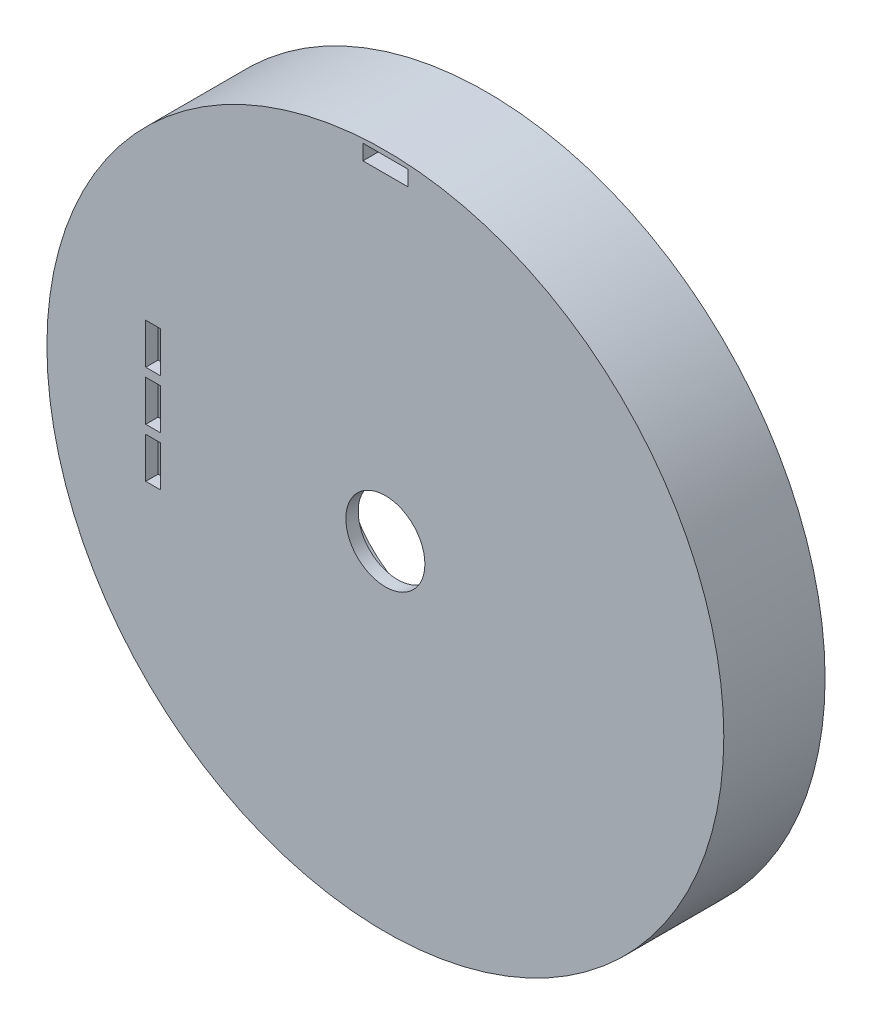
ISO-10303-21;
HEADER;
FILE_DESCRIPTION(('STEP AP214'),'2;1');
FILE_NAME('part.step','',(''),(''),'','','');
FILE_SCHEMA(('AUTOMOTIVE_DESIGN { 1 0 10303 214 1 1 1 1 }'));
ENDSEC;
DATA;
#1=APPLICATION_CONTEXT('core data for automotive mechanical design processes');
#2=APPLICATION_PROTOCOL_DEFINITION('international standard','automotive_design',2000,#1);
#3=PRODUCT_CONTEXT('',#1,'mechanical');
#4=PRODUCT('Part','Part','',(#3));
#5=PRODUCT_RELATED_PRODUCT_CATEGORY('part','',(#4));
#6=PRODUCT_DEFINITION_FORMATION('','',#4);
#7=PRODUCT_DEFINITION_CONTEXT('part definition',#1,'design');
#8=PRODUCT_DEFINITION('design','',#6,#7);
#9=PRODUCT_DEFINITION_SHAPE('','',#8);
#10=(LENGTH_UNIT() NAMED_UNIT(*) SI_UNIT(.MILLI.,.METRE.));
#11=(NAMED_UNIT(*) PLANE_ANGLE_UNIT() SI_UNIT($,.RADIAN.));
#12=(NAMED_UNIT(*) SI_UNIT($,.STERADIAN.) SOLID_ANGLE_UNIT());
#13=UNCERTAINTY_MEASURE_WITH_UNIT(LENGTH_MEASURE(1.E-05),#10,'distance_accuracy_value','');
#14=(GEOMETRIC_REPRESENTATION_CONTEXT(3) GLOBAL_UNCERTAINTY_ASSIGNED_CONTEXT((#13)) GLOBAL_UNIT_ASSIGNED_CONTEXT((#10,
#11,#12)) REPRESENTATION_CONTEXT('',''));
#15=CARTESIAN_POINT('',(0.,0.,0.));
#16=DIRECTION('',(0.,0.,1.));
#17=DIRECTION('',(1.,0.,0.));
#18=AXIS2_PLACEMENT_3D('',#15,#16,#17);
#19=CARTESIAN_POINT('',(0.,0.,0.));
#20=DIRECTION('',(0.,0.,1.));
#21=DIRECTION('',(1.,0.,0.));
#22=AXIS2_PLACEMENT_3D('',#19,#20,#21);
#23=PLANE('',#22);
#24=CARTESIAN_POINT('',(0.,0.,0.));
#25=DIRECTION('',(0.,0.,1.));
#26=DIRECTION('',(1.,0.,0.));
#27=AXIS2_PLACEMENT_3D('',#24,#25,#26);
#28=CIRCLE('',#27,10.48);
#29=CARTESIAN_POINT('',(10.48,0.,0.));
#30=VERTEX_POINT('',#29);
#31=EDGE_CURVE('E246',#30,#30,#28,.T.);
#32=ORIENTED_EDGE('',*,*,#31,.T.);
#33=EDGE_LOOP('',(#32));
#34=FACE_BOUND('',#33,.T.);
#35=CARTESIAN_POINT('',(0.,0.,0.));
#36=DIRECTION('',(0.,0.,-1.));
#37=DIRECTION('',(-1.,0.,0.));
#38=AXIS2_PLACEMENT_3D('',#35,#36,#37);
#39=CIRCLE('',#38,26.2);
#40=CARTESIAN_POINT('',(-26.2,0.,0.));
#41=VERTEX_POINT('',#40);
#42=EDGE_CURVE('E317',#41,#41,#39,.T.);
#43=ORIENTED_EDGE('',*,*,#42,.T.);
#44=EDGE_LOOP('',(#43));
#45=FACE_BOUND('',#44,.T.);
#46=ADVANCED_FACE('F32',(#34,#45),#23,.F.);
#47=CARTESIAN_POINT('',(0.,0.,-23.58));
#48=DIRECTION('',(0.,0.,-1.));
#49=DIRECTION('',(-1.,0.,0.));
#50=AXIS2_PLACEMENT_3D('',#47,#48,#49);
#51=PLANE('',#50);
#52=DIRECTION('',(0.,-1.,0.));
#53=VECTOR('',#52,1.);
#54=CARTESIAN_POINT('',(-5.94085,0.,-23.58));
#55=LINE('',#54,#53);
#56=CARTESIAN_POINT('',(-5.94085,88.425,-23.58));
#57=VERTEX_POINT('',#56);
#58=CARTESIAN_POINT('',(-5.94085,84.37055,-23.58));
#59=VERTEX_POINT('',#58);
#60=EDGE_CURVE('E255',#57,#59,#55,.T.);
#61=ORIENTED_EDGE('',*,*,#60,.T.);
#62=DIRECTION('',(1.,0.,0.));
#63=VECTOR('',#62,1.);
#64=CARTESIAN_POINT('',(0.,84.37055,-23.58));
#65=LINE('',#64,#63);
#66=CARTESIAN_POINT('',(5.94085,84.37055,-23.58));
#67=VERTEX_POINT('',#66);
#68=EDGE_CURVE('E264',#59,#67,#65,.T.);
#69=ORIENTED_EDGE('',*,*,#68,.T.);
#70=DIRECTION('',(0.,1.,0.));
#71=VECTOR('',#70,1.);
#72=CARTESIAN_POINT('',(5.94085,0.,-23.58));
#73=LINE('',#72,#71);
#74=CARTESIAN_POINT('',(5.94085,88.425,-23.58));
#75=VERTEX_POINT('',#74);
#76=EDGE_CURVE('E261',#67,#75,#73,.T.);
#77=ORIENTED_EDGE('',*,*,#76,.T.);
#78=DIRECTION('',(-1.,0.,0.));
#79=VECTOR('',#78,1.);
#80=CARTESIAN_POINT('',(0.,88.425,-23.58));
#81=LINE('',#80,#79);
#82=EDGE_CURVE('E258',#75,#57,#81,.T.);
#83=ORIENTED_EDGE('',*,*,#82,.T.);
#84=EDGE_LOOP('',(#61,#69,#77,#83));
#85=FACE_BOUND('',#84,.T.);
#86=CARTESIAN_POINT('',(0.,0.,-23.58));
#87=DIRECTION('',(0.,0.,-1.));
#88=DIRECTION('',(-1.,0.,0.));
#89=AXIS2_PLACEMENT_3D('',#86,#87,#88);
#90=CIRCLE('',#89,89.735);
#91=CARTESIAN_POINT('',(-89.735,0.,-23.58));
#92=VERTEX_POINT('',#91);
#93=EDGE_CURVE('E243',#92,#92,#90,.T.);
#94=ORIENTED_EDGE('',*,*,#93,.T.);
#95=EDGE_LOOP('',(#94));
#96=FACE_BOUND('',#95,.T.);
#97=CARTESIAN_POINT('',(0.,0.,-23.58));
#98=DIRECTION('',(0.,0.,-1.));
#99=DIRECTION('',(-1.,0.,0.));
#100=AXIS2_PLACEMENT_3D('',#97,#98,#99);
#101=CIRCLE('',#100,82.8575);
#102=CARTESIAN_POINT('',(82.8575,0.,-23.58));
#103=VERTEX_POINT('',#102);
#104=EDGE_CURVE('E305',#103,#103,#101,.T.);
#105=ORIENTED_EDGE('',*,*,#104,.F.);
#106=EDGE_LOOP('',(#105));
#107=FACE_BOUND('',#106,.T.);
#108=ADVANCED_FACE('F343',(#85,#96,#107),#51,.T.);
#109=CARTESIAN_POINT('',(0.,0.,3.275));
#110=DIRECTION('',(0.,0.,1.));
#111=DIRECTION('',(1.,0.,0.));
#112=AXIS2_PLACEMENT_3D('',#109,#110,#111);
#113=PLANE('',#112);
#114=DIRECTION('',(1.,0.,0.));
#115=VECTOR('',#114,1.);
#116=CARTESIAN_POINT('',(0.,-4.91250000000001,3.275));
#117=LINE('',#116,#115);
#118=CARTESIAN_POINT('',(-63.535,-4.91250000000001,3.275));
#119=VERTEX_POINT('',#118);
#120=CARTESIAN_POINT('',(-59.605,-4.91250000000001,3.275));
#121=VERTEX_POINT('',#120);
#122=EDGE_CURVE('E47',#119,#121,#117,.T.);
#123=ORIENTED_EDGE('',*,*,#122,.F.);
#124=DIRECTION('',(0.,-1.,0.));
#125=VECTOR('',#124,1.);
#126=CARTESIAN_POINT('',(-63.535,0.,3.275));
#127=LINE('',#126,#125);
#128=CARTESIAN_POINT('',(-63.535,5.89499999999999,3.275));
#129=VERTEX_POINT('',#128);
#130=EDGE_CURVE('E169',#129,#119,#127,.T.);
#131=ORIENTED_EDGE('',*,*,#130,.F.);
#132=DIRECTION('',(1.,0.,0.));
#133=VECTOR('',#132,1.);
#134=CARTESIAN_POINT('',(0.,5.89499999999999,3.275));
#135=LINE('',#134,#133);
#136=CARTESIAN_POINT('',(-59.605,5.89499999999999,3.275));
#137=VERTEX_POINT('',#136);
#138=EDGE_CURVE('E152',#129,#137,#135,.T.);
#139=ORIENTED_EDGE('',*,*,#138,.T.);
#140=DIRECTION('',(0.,1.,0.));
#141=VECTOR('',#140,1.);
#142=CARTESIAN_POINT('',(-59.605,0.,3.275));
#143=LINE('',#142,#141);
#144=EDGE_CURVE('E162',#121,#137,#143,.T.);
#145=ORIENTED_EDGE('',*,*,#144,.F.);
#146=EDGE_LOOP('',(#123,#131,#139,#145));
#147=FACE_BOUND('',#146,.T.);
#148=DIRECTION('',(0.,-1.,0.));
#149=VECTOR('',#148,1.);
#150=CARTESIAN_POINT('',(-63.535,0.,3.275));
#151=LINE('',#150,#149);
#152=CARTESIAN_POINT('',(-63.535,18.995,3.275));
#153=VERTEX_POINT('',#152);
#154=CARTESIAN_POINT('',(-63.535,8.18749999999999,3.275));
#155=VERTEX_POINT('',#154);
#156=EDGE_CURVE('E55',#153,#155,#151,.T.);
#157=ORIENTED_EDGE('',*,*,#156,.F.);
#158=DIRECTION('',(-1.,0.,0.));
#159=VECTOR('',#158,1.);
#160=CARTESIAN_POINT('',(0.,18.995,3.275));
#161=LINE('',#160,#159);
#162=CARTESIAN_POINT('',(-59.605,18.995,3.275));
#163=VERTEX_POINT('',#162);
#164=EDGE_CURVE('E187',#163,#153,#161,.T.);
#165=ORIENTED_EDGE('',*,*,#164,.F.);
#166=DIRECTION('',(0.,-1.,0.));
#167=VECTOR('',#166,1.);
#168=CARTESIAN_POINT('',(-59.605,0.,3.275));
#169=LINE('',#168,#167);
#170=CARTESIAN_POINT('',(-59.605,8.18749999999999,3.275));
#171=VERTEX_POINT('',#170);
#172=EDGE_CURVE('E184',#163,#171,#169,.T.);
#173=ORIENTED_EDGE('',*,*,#172,.T.);
#174=DIRECTION('',(1.,0.,0.));
#175=VECTOR('',#174,1.);
#176=CARTESIAN_POINT('',(0.,8.18749999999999,3.275));
#177=LINE('',#176,#175);
#178=EDGE_CURVE('E180',#155,#171,#177,.T.);
#179=ORIENTED_EDGE('',*,*,#178,.F.);
#180=EDGE_LOOP('',(#157,#165,#173,#179));
#181=FACE_BOUND('',#180,.T.);
#182=DIRECTION('',(0.,1.,0.));
#183=VECTOR('',#182,1.);
#184=CARTESIAN_POINT('',(-59.605,0.,3.275));
#185=LINE('',#184,#183);
#186=CARTESIAN_POINT('',(-59.605,-18.0125,3.275));
#187=VERTEX_POINT('',#186);
#188=CARTESIAN_POINT('',(-59.605,-7.20500000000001,3.275));
#189=VERTEX_POINT('',#188);
#190=EDGE_CURVE('E176',#187,#189,#185,.T.);
#191=ORIENTED_EDGE('',*,*,#190,.F.);
#192=DIRECTION('',(1.,0.,0.));
#193=VECTOR('',#192,1.);
#194=CARTESIAN_POINT('',(0.,-18.0125,3.275));
#195=LINE('',#194,#193);
#196=CARTESIAN_POINT('',(-63.535,-18.0125,3.275));
#197=VERTEX_POINT('',#196);
#198=EDGE_CURVE('E205',#197,#187,#195,.T.);
#199=ORIENTED_EDGE('',*,*,#198,.F.);
#200=DIRECTION('',(0.,-1.,0.));
#201=VECTOR('',#200,1.);
#202=CARTESIAN_POINT('',(-63.535,0.,3.275));
#203=LINE('',#202,#201);
#204=CARTESIAN_POINT('',(-63.535,-7.20500000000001,3.275));
#205=VERTEX_POINT('',#204);
#206=EDGE_CURVE('E202',#205,#197,#203,.T.);
#207=ORIENTED_EDGE('',*,*,#206,.F.);
#208=DIRECTION('',(-1.,0.,0.));
#209=VECTOR('',#208,1.);
#210=CARTESIAN_POINT('',(0.,-7.20500000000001,3.275));
#211=LINE('',#210,#209);
#212=EDGE_CURVE('E199',#189,#205,#211,.T.);
#213=ORIENTED_EDGE('',*,*,#212,.F.);
#214=EDGE_LOOP('',(#191,#199,#207,#213));
#215=FACE_BOUND('',#214,.T.);
#216=CARTESIAN_POINT('',(0.,0.,3.275));
#217=DIRECTION('',(0.,0.,1.));
#218=DIRECTION('',(1.,0.,0.));
#219=AXIS2_PLACEMENT_3D('',#216,#217,#218);
#220=CIRCLE('',#219,89.735);
#221=CARTESIAN_POINT('',(89.735,0.,3.275));
#222=VERTEX_POINT('',#221);
#223=EDGE_CURVE('E250',#222,#222,#220,.T.);
#224=ORIENTED_EDGE('',*,*,#223,.T.);
#225=EDGE_LOOP('',(#224));
#226=FACE_BOUND('',#225,.T.);
#227=CARTESIAN_POINT('',(0.,0.,3.275));
#228=DIRECTION('',(0.,0.,1.));
#229=DIRECTION('',(1.,0.,0.));
#230=AXIS2_PLACEMENT_3D('',#227,#228,#229);
#231=CIRCLE('',#230,10.48);
#232=CARTESIAN_POINT('',(10.48,0.,3.275));
#233=VERTEX_POINT('',#232);
#234=EDGE_CURVE('E247',#233,#233,#231,.T.);
#235=ORIENTED_EDGE('',*,*,#234,.F.);
#236=EDGE_LOOP('',(#235));
#237=FACE_BOUND('',#236,.T.);
#238=DIRECTION('',(0.,-1.,0.));
#239=VECTOR('',#238,1.);
#240=CARTESIAN_POINT('',(5.94085,0.,3.275));
#241=LINE('',#240,#239);
#242=CARTESIAN_POINT('',(5.94085,88.425,3.275));
#243=VERTEX_POINT('',#242);
#244=CARTESIAN_POINT('',(5.94085,84.37055,3.275));
#245=VERTEX_POINT('',#244);
#246=EDGE_CURVE('E234',#243,#245,#241,.T.);
#247=ORIENTED_EDGE('',*,*,#246,.T.);
#248=DIRECTION('',(-1.,0.,0.));
#249=VECTOR('',#248,1.);
#250=CARTESIAN_POINT('',(0.,84.37055,3.275));
#251=LINE('',#250,#249);
#252=CARTESIAN_POINT('',(-5.94085,84.37055,3.275));
#253=VERTEX_POINT('',#252);
#254=EDGE_CURVE('E237',#245,#253,#251,.T.);
#255=ORIENTED_EDGE('',*,*,#254,.T.);
#256=DIRECTION('',(0.,1.,0.));
#257=VECTOR('',#256,1.);
#258=CARTESIAN_POINT('',(-5.94085,0.,3.275));
#259=LINE('',#258,#257);
#260=CARTESIAN_POINT('',(-5.94085,88.425,3.275));
#261=VERTEX_POINT('',#260);
#262=EDGE_CURVE('E228',#253,#261,#259,.T.);
#263=ORIENTED_EDGE('',*,*,#262,.T.);
#264=DIRECTION('',(1.,0.,0.));
#265=VECTOR('',#264,1.);
#266=CARTESIAN_POINT('',(0.,88.425,3.275));
#267=LINE('',#266,#265);
#268=EDGE_CURVE('E231',#261,#243,#267,.T.);
#269=ORIENTED_EDGE('',*,*,#268,.T.);
#270=EDGE_LOOP('',(#247,#255,#263,#269));
#271=FACE_BOUND('',#270,.T.);
#272=ADVANCED_FACE('F166',(#147,#181,#215,#226,#237,#271),#113,.T.);
#273=CARTESIAN_POINT('',(0.,0.,0.));
#274=DIRECTION('',(0.,0.,1.));
#275=DIRECTION('',(1.,0.,0.));
#276=AXIS2_PLACEMENT_3D('',#273,#274,#275);
#277=CIRCLE('',#276,29.475);
#278=CARTESIAN_POINT('',(29.475,0.,0.));
#279=VERTEX_POINT('',#278);
#280=EDGE_CURVE('E11',#279,#279,#277,.F.);
#281=ORIENTED_EDGE('',*,*,#280,.F.);
#282=EDGE_LOOP('',(#281));
#283=FACE_BOUND('',#282,.T.);
#284=DIRECTION('',(0.,-1.,0.));
#285=VECTOR('',#284,1.);
#286=CARTESIAN_POINT('',(-63.535,0.,0.));
#287=LINE('',#286,#285);
#288=CARTESIAN_POINT('',(-63.535,5.89499999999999,0.));
#289=VERTEX_POINT('',#288);
#290=CARTESIAN_POINT('',(-63.535,-4.91250000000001,0.));
#291=VERTEX_POINT('',#290);
#292=EDGE_CURVE('E294',#289,#291,#287,.T.);
#293=ORIENTED_EDGE('',*,*,#292,.T.);
#294=DIRECTION('',(1.,0.,0.));
#295=VECTOR('',#294,1.);
#296=CARTESIAN_POINT('',(0.,-4.91250000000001,0.));
#297=LINE('',#296,#295);
#298=CARTESIAN_POINT('',(-59.605,-4.91250000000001,0.));
#299=VERTEX_POINT('',#298);
#300=EDGE_CURVE('E40',#291,#299,#297,.T.);
#301=ORIENTED_EDGE('',*,*,#300,.T.);
#302=DIRECTION('',(0.,1.,0.));
#303=VECTOR('',#302,1.);
#304=CARTESIAN_POINT('',(-59.605,0.,0.));
#305=LINE('',#304,#303);
#306=CARTESIAN_POINT('',(-59.605,5.89499999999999,0.));
#307=VERTEX_POINT('',#306);
#308=EDGE_CURVE('E291',#299,#307,#305,.T.);
#309=ORIENTED_EDGE('',*,*,#308,.T.);
#310=DIRECTION('',(1.,0.,0.));
#311=VECTOR('',#310,1.);
#312=CARTESIAN_POINT('',(0.,5.89499999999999,0.));
#313=LINE('',#312,#311);
#314=EDGE_CURVE('E155',#289,#307,#313,.T.);
#315=ORIENTED_EDGE('',*,*,#314,.F.);
#316=EDGE_LOOP('',(#293,#301,#309,#315));
#317=FACE_BOUND('',#316,.T.);
#318=DIRECTION('',(-1.,0.,0.));
#319=VECTOR('',#318,1.);
#320=CARTESIAN_POINT('',(0.,18.995,0.));
#321=LINE('',#320,#319);
#322=CARTESIAN_POINT('',(-59.605,18.995,0.));
#323=VERTEX_POINT('',#322);
#324=CARTESIAN_POINT('',(-63.535,18.995,0.));
#325=VERTEX_POINT('',#324);
#326=EDGE_CURVE('E285',#323,#325,#321,.T.);
#327=ORIENTED_EDGE('',*,*,#326,.T.);
#328=DIRECTION('',(0.,-1.,0.));
#329=VECTOR('',#328,1.);
#330=CARTESIAN_POINT('',(-63.535,0.,0.));
#331=LINE('',#330,#329);
#332=CARTESIAN_POINT('',(-63.535,8.18749999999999,0.));
#333=VERTEX_POINT('',#332);
#334=EDGE_CURVE('E288',#325,#333,#331,.T.);
#335=ORIENTED_EDGE('',*,*,#334,.T.);
#336=DIRECTION('',(1.,0.,0.));
#337=VECTOR('',#336,1.);
#338=CARTESIAN_POINT('',(0.,8.18749999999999,0.));
#339=LINE('',#338,#337);
#340=CARTESIAN_POINT('',(-59.605,8.18749999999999,0.));
#341=VERTEX_POINT('',#340);
#342=EDGE_CURVE('E279',#333,#341,#339,.T.);
#343=ORIENTED_EDGE('',*,*,#342,.T.);
#344=DIRECTION('',(0.,-1.,0.));
#345=VECTOR('',#344,1.);
#346=CARTESIAN_POINT('',(-59.605,0.,0.));
#347=LINE('',#346,#345);
#348=EDGE_CURVE('E282',#323,#341,#347,.T.);
#349=ORIENTED_EDGE('',*,*,#348,.F.);
#350=EDGE_LOOP('',(#327,#335,#343,#349));
#351=FACE_BOUND('',#350,.T.);
#352=DIRECTION('',(1.,0.,0.));
#353=VECTOR('',#352,1.);
#354=CARTESIAN_POINT('',(0.,-18.0125,0.));
#355=LINE('',#354,#353);
#356=CARTESIAN_POINT('',(-63.535,-18.0125,0.));
#357=VERTEX_POINT('',#356);
#358=CARTESIAN_POINT('',(-59.605,-18.0125,0.));
#359=VERTEX_POINT('',#358);
#360=EDGE_CURVE('E273',#357,#359,#355,.T.);
#361=ORIENTED_EDGE('',*,*,#360,.T.);
#362=DIRECTION('',(0.,1.,0.));
#363=VECTOR('',#362,1.);
#364=CARTESIAN_POINT('',(-59.605,0.,0.));
#365=LINE('',#364,#363);
#366=CARTESIAN_POINT('',(-59.605,-7.20500000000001,0.));
#367=VERTEX_POINT('',#366);
#368=EDGE_CURVE('E276',#359,#367,#365,.T.);
#369=ORIENTED_EDGE('',*,*,#368,.T.);
#370=DIRECTION('',(-1.,0.,0.));
#371=VECTOR('',#370,1.);
#372=CARTESIAN_POINT('',(0.,-7.20500000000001,0.));
#373=LINE('',#372,#371);
#374=CARTESIAN_POINT('',(-63.535,-7.20500000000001,0.));
#375=VERTEX_POINT('',#374);
#376=EDGE_CURVE('E267',#367,#375,#373,.T.);
#377=ORIENTED_EDGE('',*,*,#376,.T.);
#378=DIRECTION('',(0.,-1.,0.));
#379=VECTOR('',#378,1.);
#380=CARTESIAN_POINT('',(-63.535,0.,0.));
#381=LINE('',#380,#379);
#382=EDGE_CURVE('E270',#375,#357,#381,.T.);
#383=ORIENTED_EDGE('',*,*,#382,.T.);
#384=EDGE_LOOP('',(#361,#369,#377,#383));
#385=FACE_BOUND('',#384,.T.);
#386=CARTESIAN_POINT('',(0.,0.,0.));
#387=DIRECTION('',(0.,0.,-1.));
#388=DIRECTION('',(-1.,0.,0.));
#389=AXIS2_PLACEMENT_3D('',#386,#387,#388);
#390=CIRCLE('',#389,80.2375);
#391=CARTESIAN_POINT('',(-80.2375,0.,0.));
#392=VERTEX_POINT('',#391);
#393=EDGE_CURVE('E240',#392,#392,#390,.T.);
#394=ORIENTED_EDGE('',*,*,#393,.T.);
#395=EDGE_LOOP('',(#394));
#396=FACE_BOUND('',#395,.T.);
#397=ADVANCED_FACE('F298',(#283,#317,#351,#385,#396),#23,.F.);
#398=CARTESIAN_POINT('',(0.,0.,3.275));
#399=DIRECTION('',(0.,0.,-1.));
#400=DIRECTION('',(-1.,0.,0.));
#401=AXIS2_PLACEMENT_3D('',#398,#399,#400);
#402=CYLINDRICAL_SURFACE('',#401,89.735);
#403=ORIENTED_EDGE('',*,*,#223,.F.);
#404=EDGE_LOOP('',(#403));
#405=FACE_BOUND('',#404,.T.);
#406=ORIENTED_EDGE('',*,*,#93,.F.);
#407=EDGE_LOOP('',(#406));
#408=FACE_BOUND('',#407,.T.);
#409=ADVANCED_FACE('F34',(#405,#408),#402,.T.);
#410=CARTESIAN_POINT('',(0.,0.,3.275));
#411=DIRECTION('',(0.,0.,-1.));
#412=DIRECTION('',(-1.,0.,0.));
#413=AXIS2_PLACEMENT_3D('',#410,#411,#412);
#414=CYLINDRICAL_SURFACE('',#413,10.48);
#415=ORIENTED_EDGE('',*,*,#234,.T.);
#416=EDGE_LOOP('',(#415));
#417=FACE_BOUND('',#416,.T.);
#418=ORIENTED_EDGE('',*,*,#31,.F.);
#419=EDGE_LOOP('',(#418));
#420=FACE_BOUND('',#419,.T.);
#421=ADVANCED_FACE('F358',(#417,#420),#414,.F.);
#422=CARTESIAN_POINT('',(0.,0.,-23.58));
#423=DIRECTION('',(0.,0.,1.));
#424=DIRECTION('',(1.,0.,0.));
#425=AXIS2_PLACEMENT_3D('',#422,#423,#424);
#426=CYLINDRICAL_SURFACE('',#425,80.2375);
#427=ORIENTED_EDGE('',*,*,#393,.F.);
#428=EDGE_LOOP('',(#427));
#429=FACE_BOUND('',#428,.T.);
#430=CARTESIAN_POINT('',(0.,0.,-26.65999995));
#431=DIRECTION('',(0.,0.,-1.));
#432=DIRECTION('',(-1.,0.,0.));
#433=AXIS2_PLACEMENT_3D('',#430,#431,#432);
#434=CIRCLE('',#433,80.2375);
#435=CARTESIAN_POINT('',(-80.2375,0.,-26.65999995));
#436=VERTEX_POINT('',#435);
#437=EDGE_CURVE('E308',#436,#436,#434,.T.);
#438=ORIENTED_EDGE('',*,*,#437,.T.);
#439=EDGE_LOOP('',(#438));
#440=FACE_BOUND('',#439,.T.);
#441=ADVANCED_FACE('F366',(#429,#440),#426,.F.);
#442=CARTESIAN_POINT('',(-5.94085,84.37055,22.0735));
#443=DIRECTION('',(0.,1.,0.));
#444=DIRECTION('',(0.,0.,1.));
#445=AXIS2_PLACEMENT_3D('',#442,#443,#444);
#446=PLANE('',#445);
#447=DIRECTION('',(0.,0.,-1.));
#448=VECTOR('',#447,1.);
#449=CARTESIAN_POINT('',(5.94085,84.37055,22.0735));
#450=LINE('',#449,#448);
#451=EDGE_CURVE('E225',#245,#67,#450,.T.);
#452=ORIENTED_EDGE('',*,*,#451,.T.);
#453=ORIENTED_EDGE('',*,*,#68,.F.);
#454=DIRECTION('',(0.,0.,-1.));
#455=VECTOR('',#454,1.);
#456=CARTESIAN_POINT('',(-5.94085,84.37055,22.0735));
#457=LINE('',#456,#455);
#458=EDGE_CURVE('E211',#253,#59,#457,.T.);
#459=ORIENTED_EDGE('',*,*,#458,.F.);
#460=ORIENTED_EDGE('',*,*,#254,.F.);
#461=EDGE_LOOP('',(#452,#453,#459,#460));
#462=FACE_BOUND('',#461,.T.);
#463=ADVANCED_FACE('F371',(#462),#446,.T.);
#464=CARTESIAN_POINT('',(5.94085,88.425,22.0735));
#465=DIRECTION('',(-1.,0.,0.));
#466=DIRECTION('',(0.,0.,1.));
#467=AXIS2_PLACEMENT_3D('',#464,#465,#466);
#468=PLANE('',#467);
#469=DIRECTION('',(0.,0.,-1.));
#470=VECTOR('',#469,1.);
#471=CARTESIAN_POINT('',(5.94085,88.425,22.0735));
#472=LINE('',#471,#470);
#473=EDGE_CURVE('E222',#243,#75,#472,.T.);
#474=ORIENTED_EDGE('',*,*,#473,.T.);
#475=ORIENTED_EDGE('',*,*,#76,.F.);
#476=ORIENTED_EDGE('',*,*,#451,.F.);
#477=ORIENTED_EDGE('',*,*,#246,.F.);
#478=EDGE_LOOP('',(#474,#475,#476,#477));
#479=FACE_BOUND('',#478,.T.);
#480=ADVANCED_FACE('F375',(#479),#468,.T.);
#481=CARTESIAN_POINT('',(-5.94085,88.425,22.0735));
#482=DIRECTION('',(0.,-1.,0.));
#483=DIRECTION('',(0.,0.,-1.));
#484=AXIS2_PLACEMENT_3D('',#481,#482,#483);
#485=PLANE('',#484);
#486=DIRECTION('',(0.,0.,-1.));
#487=VECTOR('',#486,1.);
#488=CARTESIAN_POINT('',(-5.94085,88.425,22.0735));
#489=LINE('',#488,#487);
#490=EDGE_CURVE('E219',#261,#57,#489,.T.);
#491=ORIENTED_EDGE('',*,*,#490,.T.);
#492=ORIENTED_EDGE('',*,*,#82,.F.);
#493=ORIENTED_EDGE('',*,*,#473,.F.);
#494=ORIENTED_EDGE('',*,*,#268,.F.);
#495=EDGE_LOOP('',(#491,#492,#493,#494));
#496=FACE_BOUND('',#495,.T.);
#497=ADVANCED_FACE('F379',(#496),#485,.T.);
#498=CARTESIAN_POINT('',(-5.94085,88.425,22.0735));
#499=DIRECTION('',(1.,0.,0.));
#500=DIRECTION('',(0.,0.,-1.));
#501=AXIS2_PLACEMENT_3D('',#498,#499,#500);
#502=PLANE('',#501);
#503=ORIENTED_EDGE('',*,*,#458,.T.);
#504=ORIENTED_EDGE('',*,*,#60,.F.);
#505=ORIENTED_EDGE('',*,*,#490,.F.);
#506=ORIENTED_EDGE('',*,*,#262,.F.);
#507=EDGE_LOOP('',(#503,#504,#505,#506));
#508=FACE_BOUND('',#507,.T.);
#509=ADVANCED_FACE('F383',(#508),#502,.T.);
#510=CARTESIAN_POINT('',(-59.605,0.,-16.375));
#511=DIRECTION('',(1.,0.,0.));
#512=DIRECTION('',(0.,0.,-1.));
#513=AXIS2_PLACEMENT_3D('',#510,#511,#512);
#514=PLANE('',#513);
#515=DIRECTION('',(0.,0.,1.));
#516=VECTOR('',#515,1.);
#517=CARTESIAN_POINT('',(-59.605,-18.0125,-16.375));
#518=LINE('',#517,#516);
#519=EDGE_CURVE('E209',#359,#187,#518,.T.);
#520=ORIENTED_EDGE('',*,*,#519,.T.);
#521=ORIENTED_EDGE('',*,*,#190,.T.);
#522=DIRECTION('',(0.,0.,1.));
#523=VECTOR('',#522,1.);
#524=CARTESIAN_POINT('',(-59.605,-7.20500000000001,-16.375));
#525=LINE('',#524,#523);
#526=EDGE_CURVE('E208',#367,#189,#525,.T.);
#527=ORIENTED_EDGE('',*,*,#526,.F.);
#528=ORIENTED_EDGE('',*,*,#368,.F.);
#529=EDGE_LOOP('',(#520,#521,#527,#528));
#530=FACE_BOUND('',#529,.T.);
#531=ADVANCED_FACE('F387',(#530),#514,.F.);
#532=CARTESIAN_POINT('',(0.,-18.0125,-16.375));
#533=DIRECTION('',(0.,-1.,0.));
#534=DIRECTION('',(0.,0.,-1.));
#535=AXIS2_PLACEMENT_3D('',#532,#533,#534);
#536=PLANE('',#535);
#537=DIRECTION('',(0.,0.,1.));
#538=VECTOR('',#537,1.);
#539=CARTESIAN_POINT('',(-63.535,-18.0125,-16.375));
#540=LINE('',#539,#538);
#541=EDGE_CURVE('E212',#357,#197,#540,.T.);
#542=ORIENTED_EDGE('',*,*,#541,.T.);
#543=ORIENTED_EDGE('',*,*,#198,.T.);
#544=ORIENTED_EDGE('',*,*,#519,.F.);
#545=ORIENTED_EDGE('',*,*,#360,.F.);
#546=EDGE_LOOP('',(#542,#543,#544,#545));
#547=FACE_BOUND('',#546,.T.);
#548=ADVANCED_FACE('F391',(#547),#536,.F.);
#549=CARTESIAN_POINT('',(-63.535,0.,-16.375));
#550=DIRECTION('',(-1.,0.,0.));
#551=DIRECTION('',(0.,0.,1.));
#552=AXIS2_PLACEMENT_3D('',#549,#550,#551);
#553=PLANE('',#552);
#554=DIRECTION('',(0.,0.,1.));
#555=VECTOR('',#554,1.);
#556=CARTESIAN_POINT('',(-63.535,-7.20500000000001,-16.375));
#557=LINE('',#556,#555);
#558=EDGE_CURVE('E214',#375,#205,#557,.T.);
#559=ORIENTED_EDGE('',*,*,#558,.T.);
#560=ORIENTED_EDGE('',*,*,#206,.T.);
#561=ORIENTED_EDGE('',*,*,#541,.F.);
#562=ORIENTED_EDGE('',*,*,#382,.F.);
#563=EDGE_LOOP('',(#559,#560,#561,#562));
#564=FACE_BOUND('',#563,.T.);
#565=ADVANCED_FACE('F397',(#564),#553,.F.);
#566=CARTESIAN_POINT('',(0.,-7.20500000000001,-16.375));
#567=DIRECTION('',(0.,1.,0.));
#568=DIRECTION('',(0.,0.,1.));
#569=AXIS2_PLACEMENT_3D('',#566,#567,#568);
#570=PLANE('',#569);
#571=ORIENTED_EDGE('',*,*,#526,.T.);
#572=ORIENTED_EDGE('',*,*,#212,.T.);
#573=ORIENTED_EDGE('',*,*,#558,.F.);
#574=ORIENTED_EDGE('',*,*,#376,.F.);
#575=EDGE_LOOP('',(#571,#572,#573,#574));
#576=FACE_BOUND('',#575,.T.);
#577=ADVANCED_FACE('F393',(#576),#570,.F.);
#578=CARTESIAN_POINT('',(-63.535,0.,-16.375));
#579=DIRECTION('',(-1.,0.,0.));
#580=DIRECTION('',(0.,0.,1.));
#581=AXIS2_PLACEMENT_3D('',#578,#579,#580);
#582=PLANE('',#581);
#583=DIRECTION('',(0.,0.,1.));
#584=VECTOR('',#583,1.);
#585=CARTESIAN_POINT('',(-63.535,18.995,-16.375));
#586=LINE('',#585,#584);
#587=EDGE_CURVE('E191',#325,#153,#586,.T.);
#588=ORIENTED_EDGE('',*,*,#587,.T.);
#589=ORIENTED_EDGE('',*,*,#156,.T.);
#590=DIRECTION('',(0.,0.,1.));
#591=VECTOR('',#590,1.);
#592=CARTESIAN_POINT('',(-63.535,8.18749999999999,-16.375));
#593=LINE('',#592,#591);
#594=EDGE_CURVE('E190',#333,#155,#593,.T.);
#595=ORIENTED_EDGE('',*,*,#594,.F.);
#596=ORIENTED_EDGE('',*,*,#334,.F.);
#597=EDGE_LOOP('',(#588,#589,#595,#596));
#598=FACE_BOUND('',#597,.T.);
#599=ADVANCED_FACE('F396',(#598),#582,.F.);
#600=CARTESIAN_POINT('',(0.,18.995,-16.375));
#601=DIRECTION('',(0.,1.,0.));
#602=DIRECTION('',(0.,0.,1.));
#603=AXIS2_PLACEMENT_3D('',#600,#601,#602);
#604=PLANE('',#603);
#605=DIRECTION('',(0.,0.,1.));
#606=VECTOR('',#605,1.);
#607=CARTESIAN_POINT('',(-59.605,18.995,-16.375));
#608=LINE('',#607,#606);
#609=EDGE_CURVE('E193',#323,#163,#608,.T.);
#610=ORIENTED_EDGE('',*,*,#609,.T.);
#611=ORIENTED_EDGE('',*,*,#164,.T.);
#612=ORIENTED_EDGE('',*,*,#587,.F.);
#613=ORIENTED_EDGE('',*,*,#326,.F.);
#614=EDGE_LOOP('',(#610,#611,#612,#613));
#615=FACE_BOUND('',#614,.T.);
#616=ADVANCED_FACE('F407',(#615),#604,.F.);
#617=CARTESIAN_POINT('',(-59.605,0.,-16.375));
#618=DIRECTION('',(-1.,0.,0.));
#619=DIRECTION('',(0.,0.,1.));
#620=AXIS2_PLACEMENT_3D('',#617,#618,#619);
#621=PLANE('',#620);
#622=ORIENTED_EDGE('',*,*,#348,.T.);
#623=DIRECTION('',(0.,0.,1.));
#624=VECTOR('',#623,1.);
#625=CARTESIAN_POINT('',(-59.605,8.18749999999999,-16.375));
#626=LINE('',#625,#624);
#627=EDGE_CURVE('E195',#341,#171,#626,.T.);
#628=ORIENTED_EDGE('',*,*,#627,.T.);
#629=ORIENTED_EDGE('',*,*,#172,.F.);
#630=ORIENTED_EDGE('',*,*,#609,.F.);
#631=EDGE_LOOP('',(#622,#628,#629,#630));
#632=FACE_BOUND('',#631,.T.);
#633=ADVANCED_FACE('F411',(#632),#621,.T.);
#634=CARTESIAN_POINT('',(0.,8.18749999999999,-16.375));
#635=DIRECTION('',(0.,-1.,0.));
#636=DIRECTION('',(0.,0.,-1.));
#637=AXIS2_PLACEMENT_3D('',#634,#635,#636);
#638=PLANE('',#637);
#639=ORIENTED_EDGE('',*,*,#594,.T.);
#640=ORIENTED_EDGE('',*,*,#178,.T.);
#641=ORIENTED_EDGE('',*,*,#627,.F.);
#642=ORIENTED_EDGE('',*,*,#342,.F.);
#643=EDGE_LOOP('',(#639,#640,#641,#642));
#644=FACE_BOUND('',#643,.T.);
#645=ADVANCED_FACE('F408',(#644),#638,.F.);
#646=CARTESIAN_POINT('',(0.,-4.91250000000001,-16.375));
#647=DIRECTION('',(0.,-1.,0.));
#648=DIRECTION('',(0.,0.,-1.));
#649=AXIS2_PLACEMENT_3D('',#646,#647,#648);
#650=PLANE('',#649);
#651=DIRECTION('',(0.,0.,1.));
#652=VECTOR('',#651,1.);
#653=CARTESIAN_POINT('',(-63.535,-4.91250000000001,-16.375));
#654=LINE('',#653,#652);
#655=EDGE_CURVE('E174',#291,#119,#654,.T.);
#656=ORIENTED_EDGE('',*,*,#655,.T.);
#657=ORIENTED_EDGE('',*,*,#122,.T.);
#658=DIRECTION('',(0.,0.,1.));
#659=VECTOR('',#658,1.);
#660=CARTESIAN_POINT('',(-59.605,-4.91250000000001,-16.375));
#661=LINE('',#660,#659);
#662=EDGE_CURVE('E159',#299,#121,#661,.T.);
#663=ORIENTED_EDGE('',*,*,#662,.F.);
#664=ORIENTED_EDGE('',*,*,#300,.F.);
#665=EDGE_LOOP('',(#656,#657,#663,#664));
#666=FACE_BOUND('',#665,.T.);
#667=ADVANCED_FACE('F301',(#666),#650,.F.);
#668=CARTESIAN_POINT('',(-63.535,0.,-16.375));
#669=DIRECTION('',(-1.,0.,0.));
#670=DIRECTION('',(0.,0.,1.));
#671=AXIS2_PLACEMENT_3D('',#668,#669,#670);
#672=PLANE('',#671);
#673=DIRECTION('',(0.,0.,1.));
#674=VECTOR('',#673,1.);
#675=CARTESIAN_POINT('',(-63.535,5.89499999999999,-16.375));
#676=LINE('',#675,#674);
#677=EDGE_CURVE('E158',#289,#129,#676,.T.);
#678=ORIENTED_EDGE('',*,*,#677,.T.);
#679=ORIENTED_EDGE('',*,*,#130,.T.);
#680=ORIENTED_EDGE('',*,*,#655,.F.);
#681=ORIENTED_EDGE('',*,*,#292,.F.);
#682=EDGE_LOOP('',(#678,#679,#680,#681));
#683=FACE_BOUND('',#682,.T.);
#684=ADVANCED_FACE('F303',(#683),#672,.F.);
#685=CARTESIAN_POINT('',(0.,5.89499999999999,-16.375));
#686=DIRECTION('',(0.,-1.,0.));
#687=DIRECTION('',(0.,0.,-1.));
#688=AXIS2_PLACEMENT_3D('',#685,#686,#687);
#689=PLANE('',#688);
#690=ORIENTED_EDGE('',*,*,#314,.T.);
#691=DIRECTION('',(0.,0.,1.));
#692=VECTOR('',#691,1.);
#693=CARTESIAN_POINT('',(-59.605,5.89499999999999,-16.375));
#694=LINE('',#693,#692);
#695=EDGE_CURVE('E147',#307,#137,#694,.T.);
#696=ORIENTED_EDGE('',*,*,#695,.T.);
#697=ORIENTED_EDGE('',*,*,#138,.F.);
#698=ORIENTED_EDGE('',*,*,#677,.F.);
#699=EDGE_LOOP('',(#690,#696,#697,#698));
#700=FACE_BOUND('',#699,.T.);
#701=ADVANCED_FACE('F149',(#700),#689,.T.);
#702=CARTESIAN_POINT('',(-59.605,0.,-16.375));
#703=DIRECTION('',(1.,0.,0.));
#704=DIRECTION('',(0.,0.,-1.));
#705=AXIS2_PLACEMENT_3D('',#702,#703,#704);
#706=PLANE('',#705);
#707=ORIENTED_EDGE('',*,*,#662,.T.);
#708=ORIENTED_EDGE('',*,*,#144,.T.);
#709=ORIENTED_EDGE('',*,*,#695,.F.);
#710=ORIENTED_EDGE('',*,*,#308,.F.);
#711=EDGE_LOOP('',(#707,#708,#709,#710));
#712=FACE_BOUND('',#711,.T.);
#713=ADVANCED_FACE('F163',(#712),#706,.F.);
#714=CARTESIAN_POINT('',(0.,0.,-26.65999995));
#715=DIRECTION('',(0.,0.,-1.));
#716=DIRECTION('',(-1.,0.,0.));
#717=AXIS2_PLACEMENT_3D('',#714,#715,#716);
#718=PLANE('',#717);
#719=CARTESIAN_POINT('',(0.,0.,-26.65999995));
#720=DIRECTION('',(0.,0.,-1.));
#721=DIRECTION('',(-1.,0.,0.));
#722=AXIS2_PLACEMENT_3D('',#719,#720,#721);
#723=CIRCLE('',#722,82.8575);
#724=CARTESIAN_POINT('',(82.8575,0.,-26.65999995));
#725=VERTEX_POINT('',#724);
#726=EDGE_CURVE('E181',#725,#725,#723,.T.);
#727=ORIENTED_EDGE('',*,*,#726,.T.);
#728=EDGE_LOOP('',(#727));
#729=FACE_BOUND('',#728,.T.);
#730=ORIENTED_EDGE('',*,*,#437,.F.);
#731=EDGE_LOOP('',(#730));
#732=FACE_BOUND('',#731,.T.);
#733=ADVANCED_FACE('F338',(#729,#732),#718,.T.);
#734=CARTESIAN_POINT('',(0.,0.,-26.65999995));
#735=DIRECTION('',(0.,0.,1.));
#736=DIRECTION('',(1.,0.,0.));
#737=AXIS2_PLACEMENT_3D('',#734,#735,#736);
#738=CYLINDRICAL_SURFACE('',#737,82.8575);
#739=CARTESIAN_POINT('',(82.8575,0.,-26.65999995));
#740=CARTESIAN_POINT('',(82.8575,0.,-26.6279166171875));
#741=CARTESIAN_POINT('',(82.8575,0.,-26.595833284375));
#742=CARTESIAN_POINT('',(82.8575,0.,-26.53166661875));
#743=CARTESIAN_POINT('',(82.8575,0.,-26.4995832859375));
#744=CARTESIAN_POINT('',(82.8575,0.,-26.4354166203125));
#745=CARTESIAN_POINT('',(82.8575,0.,-26.4033332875));
#746=CARTESIAN_POINT('',(82.8575,0.,-26.339166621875));
#747=CARTESIAN_POINT('',(82.8575,0.,-26.3070832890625));
#748=CARTESIAN_POINT('',(82.8575,0.,-26.2429166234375));
#749=CARTESIAN_POINT('',(82.8575,0.,-26.210833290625));
#750=CARTESIAN_POINT('',(82.8575,0.,-26.146666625));
#751=CARTESIAN_POINT('',(82.8575,0.,-26.1145832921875));
#752=CARTESIAN_POINT('',(82.8575,0.,-26.0504166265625));
#753=CARTESIAN_POINT('',(82.8575,0.,-26.01833329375));
#754=CARTESIAN_POINT('',(82.8575,0.,-25.954166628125));
#755=CARTESIAN_POINT('',(82.8575,0.,-25.9220832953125));
#756=CARTESIAN_POINT('',(82.8575,0.,-25.8579166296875));
#757=CARTESIAN_POINT('',(82.8575,0.,-25.825833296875));
#758=CARTESIAN_POINT('',(82.8575,0.,-25.76166663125));
#759=CARTESIAN_POINT('',(82.8575,0.,-25.7295832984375));
#760=CARTESIAN_POINT('',(82.8575,0.,-25.6654166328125));
#761=CARTESIAN_POINT('',(82.8575,0.,-25.6333333));
#762=CARTESIAN_POINT('',(82.8575,0.,-25.569166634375));
#763=CARTESIAN_POINT('',(82.8575,0.,-25.5370833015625));
#764=CARTESIAN_POINT('',(82.8575,0.,-25.4729166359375));
#765=CARTESIAN_POINT('',(82.8575,0.,-25.440833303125));
#766=CARTESIAN_POINT('',(82.8575,0.,-25.3766666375));
#767=CARTESIAN_POINT('',(82.8575,0.,-25.3445833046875));
#768=CARTESIAN_POINT('',(82.8575,0.,-25.2804166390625));
#769=CARTESIAN_POINT('',(82.8575,0.,-25.24833330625));
#770=CARTESIAN_POINT('',(82.8575,0.,-25.184166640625));
#771=CARTESIAN_POINT('',(82.8575,0.,-25.1520833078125));
#772=CARTESIAN_POINT('',(82.8575,0.,-25.0879166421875));
#773=CARTESIAN_POINT('',(82.8575,0.,-25.055833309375));
#774=CARTESIAN_POINT('',(82.8575,0.,-24.99166664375));
#775=CARTESIAN_POINT('',(82.8575,0.,-24.9595833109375));
#776=CARTESIAN_POINT('',(82.8575,0.,-24.8954166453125));
#777=CARTESIAN_POINT('',(82.8575,0.,-24.8633333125));
#778=CARTESIAN_POINT('',(82.8575,0.,-24.799166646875));
#779=CARTESIAN_POINT('',(82.8575,0.,-24.7670833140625));
#780=CARTESIAN_POINT('',(82.8575,0.,-24.7029166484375));
#781=CARTESIAN_POINT('',(82.8575,0.,-24.670833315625));
#782=CARTESIAN_POINT('',(82.8575,0.,-24.60666665));
#783=CARTESIAN_POINT('',(82.8575,0.,-24.5745833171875));
#784=CARTESIAN_POINT('',(82.8575,0.,-24.5104166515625));
#785=CARTESIAN_POINT('',(82.8575,0.,-24.47833331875));
#786=CARTESIAN_POINT('',(82.8575,0.,-24.414166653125));
#787=CARTESIAN_POINT('',(82.8575,0.,-24.3820833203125));
#788=CARTESIAN_POINT('',(82.8575,0.,-24.3179166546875));
#789=CARTESIAN_POINT('',(82.8575,0.,-24.285833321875));
#790=CARTESIAN_POINT('',(82.8575,0.,-24.22166665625));
#791=CARTESIAN_POINT('',(82.8575,0.,-24.1895833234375));
#792=CARTESIAN_POINT('',(82.8575,0.,-24.1254166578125));
#793=CARTESIAN_POINT('',(82.8575,0.,-24.093333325));
#794=CARTESIAN_POINT('',(82.8575,0.,-24.029166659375));
#795=CARTESIAN_POINT('',(82.8575,0.,-23.9970833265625));
#796=CARTESIAN_POINT('',(82.8575,0.,-23.9329166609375));
#797=CARTESIAN_POINT('',(82.8575,0.,-23.900833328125));
#798=CARTESIAN_POINT('',(82.8575,0.,-23.8366666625));
#799=CARTESIAN_POINT('',(82.8575,0.,-23.8045833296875));
#800=CARTESIAN_POINT('',(82.8575,0.,-23.7404166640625));
#801=CARTESIAN_POINT('',(82.8575,0.,-23.70833333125));
#802=CARTESIAN_POINT('',(82.8575,0.,-23.644166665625));
#803=CARTESIAN_POINT('',(82.8575,0.,-23.6120833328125));
#804=CARTESIAN_POINT('',(82.8575,0.,-23.58));
#805=B_SPLINE_CURVE_WITH_KNOTS('',3,(#739,#740,#741,#742,#743,#744,#745,#746,#747,#748,#749,
#750,#751,#752,#753,#754,#755,#756,#757,#758,#759,#760,#761,#762,#763,#764,#765,#766,#767,#768,
#769,#770,#771,#772,#773,#774,#775,#776,#777,#778,#779,#780,#781,#782,#783,#784,#785,#786,#787,
#788,#789,#790,#791,#792,#793,#794,#795,#796,#797,#798,#799,#800,#801,#802,#803,#804),
.UNSPECIFIED.,.F.,.F.,(4,2,2,2,2,2,2,2,2,2,2,2,2,2,2,2,2,2,2,2,2,2,2,2,2,2,2,2,2,2,2,2,4),(0.,
0.096249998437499,0.192499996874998,0.288749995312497,0.384999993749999,0.481249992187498,
0.577499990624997,0.673749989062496,0.769999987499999,0.866249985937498,0.962499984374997,
1.0587499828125,1.15499998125,1.2512499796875,1.347499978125,1.4437499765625,1.539999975,
1.6362499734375,1.732499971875,1.8287499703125,1.92499996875,2.0212499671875,2.117499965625,
2.2137499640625,2.3099999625,2.4062499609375,2.502499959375,2.5987499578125,2.69499995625,
2.79124995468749,2.887499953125,2.9837499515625,3.07999995),.UNSPECIFIED.);
#806=EDGE_CURVE('BSEAM329',#725,#103,#805,.T.);
#807=ORIENTED_EDGE('',*,*,#726,.F.);
#808=ORIENTED_EDGE('',*,*,#104,.T.);
#809=ORIENTED_EDGE('',*,*,#806,.T.);
#810=ORIENTED_EDGE('',*,*,#806,.F.);
#811=EDGE_LOOP('',(#807,#809,#808,#810));
#812=FACE_BOUND('',#811,.T.);
#813=ADVANCED_FACE('F329',(#812),#738,.T.);
#814=CARTESIAN_POINT('',(0.,0.,-11.79));
#815=DIRECTION('',(0.,0.,-1.));
#816=DIRECTION('',(-1.,0.,0.));
#817=AXIS2_PLACEMENT_3D('',#814,#815,#816);
#818=PLANE('',#817);
#819=CARTESIAN_POINT('',(0.,0.,-11.79));
#820=DIRECTION('',(0.,0.,-1.));
#821=DIRECTION('',(-1.,0.,0.));
#822=AXIS2_PLACEMENT_3D('',#819,#820,#821);
#823=CIRCLE('',#822,29.475);
#824=CARTESIAN_POINT('',(-29.475,0.,-11.79));
#825=VERTEX_POINT('',#824);
#826=EDGE_CURVE('E313',#825,#825,#823,.T.);
#827=ORIENTED_EDGE('',*,*,#826,.T.);
#828=EDGE_LOOP('',(#827));
#829=FACE_BOUND('',#828,.T.);
#830=CARTESIAN_POINT('',(0.,0.,-11.79));
#831=DIRECTION('',(0.,0.,-1.));
#832=DIRECTION('',(-1.,0.,0.));
#833=AXIS2_PLACEMENT_3D('',#830,#831,#832);
#834=CIRCLE('',#833,26.2);
#835=CARTESIAN_POINT('',(-26.2,0.,-11.79));
#836=VERTEX_POINT('',#835);
#837=EDGE_CURVE('E316',#836,#836,#834,.T.);
#838=ORIENTED_EDGE('',*,*,#837,.F.);
#839=EDGE_LOOP('',(#838));
#840=FACE_BOUND('',#839,.T.);
#841=ADVANCED_FACE('F326',(#829,#840),#818,.T.);
#842=CARTESIAN_POINT('',(0.,0.,-11.79));
#843=DIRECTION('',(0.,0.,1.));
#844=DIRECTION('',(1.,0.,0.));
#845=AXIS2_PLACEMENT_3D('',#842,#843,#844);
#846=CYLINDRICAL_SURFACE('',#845,29.475);
#847=ORIENTED_EDGE('',*,*,#826,.F.);
#848=EDGE_LOOP('',(#847));
#849=FACE_BOUND('',#848,.T.);
#850=ORIENTED_EDGE('',*,*,#280,.T.);
#851=EDGE_LOOP('',(#850));
#852=FACE_BOUND('',#851,.T.);
#853=ADVANCED_FACE('F328',(#849,#852),#846,.T.);
#854=CARTESIAN_POINT('',(0.,0.,-11.79));
#855=DIRECTION('',(0.,0.,1.));
#856=DIRECTION('',(1.,0.,0.));
#857=AXIS2_PLACEMENT_3D('',#854,#855,#856);
#858=CYLINDRICAL_SURFACE('',#857,26.2);
#859=ORIENTED_EDGE('',*,*,#837,.T.);
#860=EDGE_LOOP('',(#859));
#861=FACE_BOUND('',#860,.T.);
#862=ORIENTED_EDGE('',*,*,#42,.F.);
#863=EDGE_LOOP('',(#862));
#864=FACE_BOUND('',#863,.T.);
#865=ADVANCED_FACE('F323',(#861,#864),#858,.F.);
#866=CLOSED_SHELL('',(#46,#108,#272,#397,#409,#421,#441,#463,#480,#497,#509,#531,#548,#565,#577,
#599,#616,#633,#645,#667,#684,#701,#713,#733,#813,#841,#853,#865));
#867=MANIFOLD_SOLID_BREP('B2',#866);
#868=ADVANCED_BREP_SHAPE_REPRESENTATION('',(#18,#867),#14);
#869=SHAPE_DEFINITION_REPRESENTATION(#9,#868);
ENDSEC;
END-ISO-10303-21;
